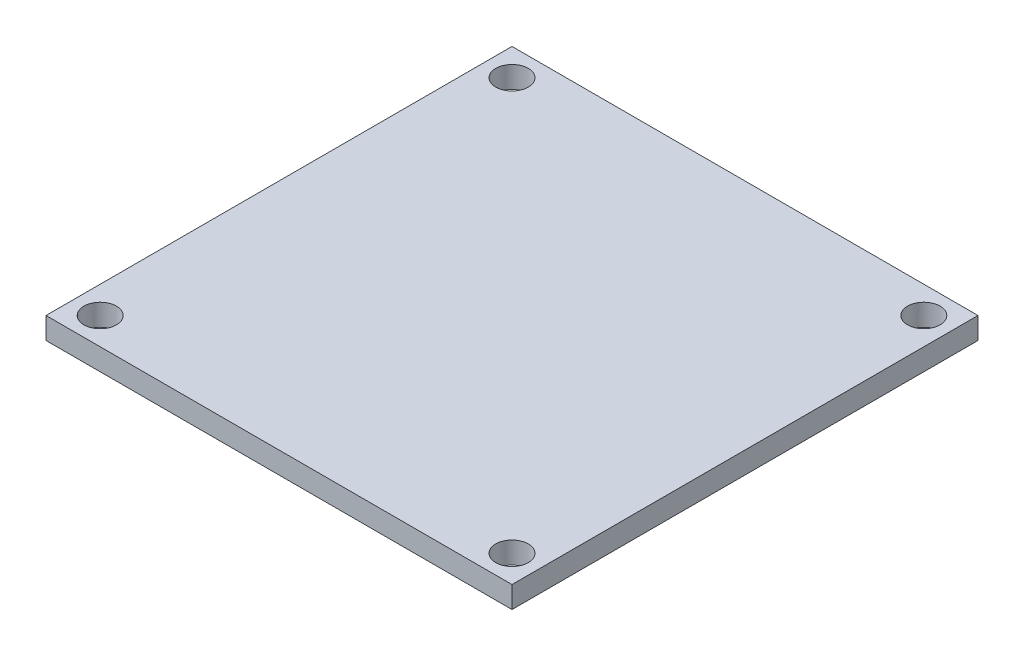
ISO-10303-21;
HEADER;
FILE_DESCRIPTION(('STEP AP214'),'2;1');
FILE_NAME('part.step','',(''),(''),'','','');
FILE_SCHEMA(('AUTOMOTIVE_DESIGN { 1 0 10303 214 1 1 1 1 }'));
ENDSEC;
DATA;
#1=APPLICATION_CONTEXT('core data for automotive mechanical design processes');
#2=APPLICATION_PROTOCOL_DEFINITION('international standard','automotive_design',2000,#1);
#3=PRODUCT_CONTEXT('',#1,'mechanical');
#4=PRODUCT('Part','Part','',(#3));
#5=PRODUCT_RELATED_PRODUCT_CATEGORY('part','',(#4));
#6=PRODUCT_DEFINITION_FORMATION('','',#4);
#7=PRODUCT_DEFINITION_CONTEXT('part definition',#1,'design');
#8=PRODUCT_DEFINITION('design','',#6,#7);
#9=PRODUCT_DEFINITION_SHAPE('','',#8);
#10=(LENGTH_UNIT() NAMED_UNIT(*) SI_UNIT(.MILLI.,.METRE.));
#11=(NAMED_UNIT(*) PLANE_ANGLE_UNIT() SI_UNIT($,.RADIAN.));
#12=(NAMED_UNIT(*) SI_UNIT($,.STERADIAN.) SOLID_ANGLE_UNIT());
#13=UNCERTAINTY_MEASURE_WITH_UNIT(LENGTH_MEASURE(1.E-05),#10,'distance_accuracy_value','');
#14=(GEOMETRIC_REPRESENTATION_CONTEXT(3) GLOBAL_UNCERTAINTY_ASSIGNED_CONTEXT((#13)) GLOBAL_UNIT_ASSIGNED_CONTEXT((#10,
#11,#12)) REPRESENTATION_CONTEXT('',''));
#15=CARTESIAN_POINT('',(0.,0.,0.));
#16=DIRECTION('',(0.,0.,1.));
#17=DIRECTION('',(1.,0.,0.));
#18=AXIS2_PLACEMENT_3D('',#15,#16,#17);
#19=CARTESIAN_POINT('',(21.5,2.,21.5));
#20=DIRECTION('',(-1.,0.,0.));
#21=DIRECTION('',(0.,0.,1.));
#22=AXIS2_PLACEMENT_3D('',#19,#20,#21);
#23=PLANE('',#22);
#24=DIRECTION('',(0.,0.,-1.));
#25=VECTOR('',#24,1.);
#26=CARTESIAN_POINT('',(21.5,0.,21.5));
#27=LINE('',#26,#25);
#28=CARTESIAN_POINT('',(21.5,0.,21.5));
#29=VERTEX_POINT('',#28);
#30=CARTESIAN_POINT('',(21.5,0.,-21.5));
#31=VERTEX_POINT('',#30);
#32=EDGE_CURVE('E96',#29,#31,#27,.T.);
#33=ORIENTED_EDGE('',*,*,#32,.T.);
#34=DIRECTION('',(0.,-1.,0.));
#35=VECTOR('',#34,1.);
#36=CARTESIAN_POINT('',(21.5,2.,-21.5));
#37=LINE('',#36,#35);
#38=CARTESIAN_POINT('',(21.5,2.,-21.5));
#39=VERTEX_POINT('',#38);
#40=EDGE_CURVE('E11',#39,#31,#37,.T.);
#41=ORIENTED_EDGE('',*,*,#40,.F.);
#42=DIRECTION('',(0.,0.,-1.));
#43=VECTOR('',#42,1.);
#44=CARTESIAN_POINT('',(21.5,2.,21.5));
#45=LINE('',#44,#43);
#46=CARTESIAN_POINT('',(21.5,2.,21.5));
#47=VERTEX_POINT('',#46);
#48=EDGE_CURVE('E84',#47,#39,#45,.T.);
#49=ORIENTED_EDGE('',*,*,#48,.F.);
#50=DIRECTION('',(0.,-1.,0.));
#51=VECTOR('',#50,1.);
#52=CARTESIAN_POINT('',(21.5,2.,21.5));
#53=LINE('',#52,#51);
#54=EDGE_CURVE('E92',#47,#29,#53,.T.);
#55=ORIENTED_EDGE('',*,*,#54,.T.);
#56=EDGE_LOOP('',(#33,#41,#49,#55));
#57=FACE_BOUND('',#56,.T.);
#58=ADVANCED_FACE('F33',(#57),#23,.F.);
#59=CARTESIAN_POINT('',(-21.5,2.,-21.5));
#60=DIRECTION('',(0.,0.,1.));
#61=DIRECTION('',(1.,0.,0.));
#62=AXIS2_PLACEMENT_3D('',#59,#60,#61);
#63=PLANE('',#62);
#64=DIRECTION('',(-1.,0.,0.));
#65=VECTOR('',#64,1.);
#66=CARTESIAN_POINT('',(-21.5,0.,-21.5));
#67=LINE('',#66,#65);
#68=CARTESIAN_POINT('',(-21.5,0.,-21.5));
#69=VERTEX_POINT('',#68);
#70=EDGE_CURVE('E88',#31,#69,#67,.T.);
#71=ORIENTED_EDGE('',*,*,#70,.T.);
#72=DIRECTION('',(0.,-1.,0.));
#73=VECTOR('',#72,1.);
#74=CARTESIAN_POINT('',(-21.5,2.,-21.5));
#75=LINE('',#74,#73);
#76=CARTESIAN_POINT('',(-21.5,2.,-21.5));
#77=VERTEX_POINT('',#76);
#78=EDGE_CURVE('E41',#77,#69,#75,.T.);
#79=ORIENTED_EDGE('',*,*,#78,.F.);
#80=DIRECTION('',(-1.,0.,0.));
#81=VECTOR('',#80,1.);
#82=CARTESIAN_POINT('',(-21.5,2.,-21.5));
#83=LINE('',#82,#81);
#84=EDGE_CURVE('E79',#39,#77,#83,.T.);
#85=ORIENTED_EDGE('',*,*,#84,.F.);
#86=ORIENTED_EDGE('',*,*,#40,.T.);
#87=EDGE_LOOP('',(#71,#79,#85,#86));
#88=FACE_BOUND('',#87,.T.);
#89=ADVANCED_FACE('F87',(#88),#63,.F.);
#90=CARTESIAN_POINT('',(-21.5,2.,21.5));
#91=DIRECTION('',(1.,0.,0.));
#92=DIRECTION('',(0.,0.,-1.));
#93=AXIS2_PLACEMENT_3D('',#90,#91,#92);
#94=PLANE('',#93);
#95=DIRECTION('',(0.,0.,1.));
#96=VECTOR('',#95,1.);
#97=CARTESIAN_POINT('',(-21.5,0.,21.5));
#98=LINE('',#97,#96);
#99=CARTESIAN_POINT('',(-21.5,0.,21.5));
#100=VERTEX_POINT('',#99);
#101=EDGE_CURVE('E66',#69,#100,#98,.T.);
#102=ORIENTED_EDGE('',*,*,#101,.T.);
#103=DIRECTION('',(0.,-1.,0.));
#104=VECTOR('',#103,1.);
#105=CARTESIAN_POINT('',(-21.5,2.,21.5));
#106=LINE('',#105,#104);
#107=CARTESIAN_POINT('',(-21.5,2.,21.5));
#108=VERTEX_POINT('',#107);
#109=EDGE_CURVE('E89',#108,#100,#106,.T.);
#110=ORIENTED_EDGE('',*,*,#109,.F.);
#111=DIRECTION('',(0.,0.,1.));
#112=VECTOR('',#111,1.);
#113=CARTESIAN_POINT('',(-21.5,2.,21.5));
#114=LINE('',#113,#112);
#115=EDGE_CURVE('E82',#77,#108,#114,.T.);
#116=ORIENTED_EDGE('',*,*,#115,.F.);
#117=ORIENTED_EDGE('',*,*,#78,.T.);
#118=EDGE_LOOP('',(#102,#110,#116,#117));
#119=FACE_BOUND('',#118,.T.);
#120=ADVANCED_FACE('F90',(#119),#94,.F.);
#121=CARTESIAN_POINT('',(-21.5,2.,21.5));
#122=DIRECTION('',(0.,0.,-1.));
#123=DIRECTION('',(-1.,0.,0.));
#124=AXIS2_PLACEMENT_3D('',#121,#122,#123);
#125=PLANE('',#124);
#126=DIRECTION('',(1.,0.,0.));
#127=VECTOR('',#126,1.);
#128=CARTESIAN_POINT('',(-21.5,0.,21.5));
#129=LINE('',#128,#127);
#130=EDGE_CURVE('E72',#100,#29,#129,.T.);
#131=ORIENTED_EDGE('',*,*,#130,.T.);
#132=ORIENTED_EDGE('',*,*,#54,.F.);
#133=DIRECTION('',(1.,0.,0.));
#134=VECTOR('',#133,1.);
#135=CARTESIAN_POINT('',(-21.5,2.,21.5));
#136=LINE('',#135,#134);
#137=EDGE_CURVE('E49',#108,#47,#136,.T.);
#138=ORIENTED_EDGE('',*,*,#137,.F.);
#139=ORIENTED_EDGE('',*,*,#109,.T.);
#140=EDGE_LOOP('',(#131,#132,#138,#139));
#141=FACE_BOUND('',#140,.T.);
#142=ADVANCED_FACE('F104',(#141),#125,.F.);
#143=CARTESIAN_POINT('',(0.,2.,0.));
#144=DIRECTION('',(0.,-1.,0.));
#145=DIRECTION('',(0.,0.,-1.));
#146=AXIS2_PLACEMENT_3D('',#143,#144,#145);
#147=PLANE('',#146);
#148=CARTESIAN_POINT('',(19.,2.,-19.));
#149=DIRECTION('',(0.,1.,0.));
#150=DIRECTION('',(0.,0.,1.));
#151=AXIS2_PLACEMENT_3D('',#148,#149,#150);
#152=CIRCLE('',#151,1.5);
#153=CARTESIAN_POINT('',(19.,2.,-17.5));
#154=VERTEX_POINT('',#153);
#155=EDGE_CURVE('E123',#154,#154,#152,.T.);
#156=ORIENTED_EDGE('',*,*,#155,.F.);
#157=EDGE_LOOP('',(#156));
#158=FACE_BOUND('',#157,.T.);
#159=CARTESIAN_POINT('',(-19.,2.,19.));
#160=DIRECTION('',(0.,1.,0.));
#161=DIRECTION('',(0.,0.,1.));
#162=AXIS2_PLACEMENT_3D('',#159,#160,#161);
#163=CIRCLE('',#162,1.5);
#164=CARTESIAN_POINT('',(-19.,2.,20.5));
#165=VERTEX_POINT('',#164);
#166=EDGE_CURVE('E116',#165,#165,#163,.T.);
#167=ORIENTED_EDGE('',*,*,#166,.F.);
#168=EDGE_LOOP('',(#167));
#169=FACE_BOUND('',#168,.T.);
#170=CARTESIAN_POINT('',(19.,2.,19.));
#171=DIRECTION('',(0.,1.,0.));
#172=DIRECTION('',(0.,0.,1.));
#173=AXIS2_PLACEMENT_3D('',#170,#171,#172);
#174=CIRCLE('',#173,1.5);
#175=CARTESIAN_POINT('',(19.,2.,20.5));
#176=VERTEX_POINT('',#175);
#177=EDGE_CURVE('E128',#176,#176,#174,.T.);
#178=ORIENTED_EDGE('',*,*,#177,.F.);
#179=EDGE_LOOP('',(#178));
#180=FACE_BOUND('',#179,.T.);
#181=CARTESIAN_POINT('',(-19.,2.,-19.));
#182=DIRECTION('',(0.,1.,0.));
#183=DIRECTION('',(0.,0.,1.));
#184=AXIS2_PLACEMENT_3D('',#181,#182,#183);
#185=CIRCLE('',#184,1.5);
#186=CARTESIAN_POINT('',(-19.,2.,-17.5));
#187=VERTEX_POINT('',#186);
#188=EDGE_CURVE('E110',#187,#187,#185,.T.);
#189=ORIENTED_EDGE('',*,*,#188,.F.);
#190=EDGE_LOOP('',(#189));
#191=FACE_BOUND('',#190,.T.);
#192=ORIENTED_EDGE('',*,*,#48,.T.);
#193=ORIENTED_EDGE('',*,*,#84,.T.);
#194=ORIENTED_EDGE('',*,*,#115,.T.);
#195=ORIENTED_EDGE('',*,*,#137,.T.);
#196=EDGE_LOOP('',(#192,#193,#194,#195));
#197=FACE_BOUND('',#196,.T.);
#198=ADVANCED_FACE('F80',(#158,#169,#180,#191,#197),#147,.F.);
#199=CARTESIAN_POINT('',(0.,0.,0.));
#200=DIRECTION('',(0.,-1.,0.));
#201=DIRECTION('',(0.,0.,-1.));
#202=AXIS2_PLACEMENT_3D('',#199,#200,#201);
#203=PLANE('',#202);
#204=CARTESIAN_POINT('',(19.,0.,-19.));
#205=DIRECTION('',(0.,1.,0.));
#206=DIRECTION('',(0.,0.,1.));
#207=AXIS2_PLACEMENT_3D('',#204,#205,#206);
#208=CIRCLE('',#207,1.5);
#209=CARTESIAN_POINT('',(19.,0.,-17.5));
#210=VERTEX_POINT('',#209);
#211=EDGE_CURVE('E113',#210,#210,#208,.T.);
#212=ORIENTED_EDGE('',*,*,#211,.T.);
#213=EDGE_LOOP('',(#212));
#214=FACE_BOUND('',#213,.T.);
#215=CARTESIAN_POINT('',(-19.,0.,19.));
#216=DIRECTION('',(0.,1.,0.));
#217=DIRECTION('',(0.,0.,1.));
#218=AXIS2_PLACEMENT_3D('',#215,#216,#217);
#219=CIRCLE('',#218,1.5);
#220=CARTESIAN_POINT('',(-19.,0.,20.5));
#221=VERTEX_POINT('',#220);
#222=EDGE_CURVE('E119',#221,#221,#219,.T.);
#223=ORIENTED_EDGE('',*,*,#222,.T.);
#224=EDGE_LOOP('',(#223));
#225=FACE_BOUND('',#224,.T.);
#226=CARTESIAN_POINT('',(19.,0.,19.));
#227=DIRECTION('',(0.,1.,0.));
#228=DIRECTION('',(0.,0.,1.));
#229=AXIS2_PLACEMENT_3D('',#226,#227,#228);
#230=CIRCLE('',#229,1.5);
#231=CARTESIAN_POINT('',(19.,0.,20.5));
#232=VERTEX_POINT('',#231);
#233=EDGE_CURVE('E120',#232,#232,#230,.T.);
#234=ORIENTED_EDGE('',*,*,#233,.T.);
#235=EDGE_LOOP('',(#234));
#236=FACE_BOUND('',#235,.T.);
#237=CARTESIAN_POINT('',(-19.,0.,-19.));
#238=DIRECTION('',(0.,1.,0.));
#239=DIRECTION('',(0.,0.,1.));
#240=AXIS2_PLACEMENT_3D('',#237,#238,#239);
#241=CIRCLE('',#240,1.5);
#242=CARTESIAN_POINT('',(-19.,0.,-17.5));
#243=VERTEX_POINT('',#242);
#244=EDGE_CURVE('E99',#243,#243,#241,.T.);
#245=ORIENTED_EDGE('',*,*,#244,.T.);
#246=EDGE_LOOP('',(#245));
#247=FACE_BOUND('',#246,.T.);
#248=ORIENTED_EDGE('',*,*,#32,.F.);
#249=ORIENTED_EDGE('',*,*,#130,.F.);
#250=ORIENTED_EDGE('',*,*,#101,.F.);
#251=ORIENTED_EDGE('',*,*,#70,.F.);
#252=EDGE_LOOP('',(#248,#249,#250,#251));
#253=FACE_BOUND('',#252,.T.);
#254=ADVANCED_FACE('F107',(#214,#225,#236,#247,#253),#203,.T.);
#255=CARTESIAN_POINT('',(-19.,0.,-19.));
#256=DIRECTION('',(0.,1.,0.));
#257=DIRECTION('',(0.,0.,1.));
#258=AXIS2_PLACEMENT_3D('',#255,#256,#257);
#259=CYLINDRICAL_SURFACE('',#258,1.5);
#260=ORIENTED_EDGE('',*,*,#244,.F.);
#261=EDGE_LOOP('',(#260));
#262=FACE_BOUND('',#261,.T.);
#263=ORIENTED_EDGE('',*,*,#188,.T.);
#264=EDGE_LOOP('',(#263));
#265=FACE_BOUND('',#264,.T.);
#266=ADVANCED_FACE('F140',(#262,#265),#259,.F.);
#267=CARTESIAN_POINT('',(19.,0.,19.));
#268=DIRECTION('',(0.,1.,0.));
#269=DIRECTION('',(0.,0.,1.));
#270=AXIS2_PLACEMENT_3D('',#267,#268,#269);
#271=CYLINDRICAL_SURFACE('',#270,1.5);
#272=ORIENTED_EDGE('',*,*,#233,.F.);
#273=EDGE_LOOP('',(#272));
#274=FACE_BOUND('',#273,.T.);
#275=ORIENTED_EDGE('',*,*,#177,.T.);
#276=EDGE_LOOP('',(#275));
#277=FACE_BOUND('',#276,.T.);
#278=ADVANCED_FACE('F136',(#274,#277),#271,.F.);
#279=CARTESIAN_POINT('',(-19.,0.,19.));
#280=DIRECTION('',(0.,1.,0.));
#281=DIRECTION('',(0.,0.,1.));
#282=AXIS2_PLACEMENT_3D('',#279,#280,#281);
#283=CYLINDRICAL_SURFACE('',#282,1.5);
#284=ORIENTED_EDGE('',*,*,#222,.F.);
#285=EDGE_LOOP('',(#284));
#286=FACE_BOUND('',#285,.T.);
#287=ORIENTED_EDGE('',*,*,#166,.T.);
#288=EDGE_LOOP('',(#287));
#289=FACE_BOUND('',#288,.T.);
#290=ADVANCED_FACE('F139',(#286,#289),#283,.F.);
#291=CARTESIAN_POINT('',(19.,0.,-19.));
#292=DIRECTION('',(0.,1.,0.));
#293=DIRECTION('',(0.,0.,1.));
#294=AXIS2_PLACEMENT_3D('',#291,#292,#293);
#295=CYLINDRICAL_SURFACE('',#294,1.5);
#296=ORIENTED_EDGE('',*,*,#211,.F.);
#297=EDGE_LOOP('',(#296));
#298=FACE_BOUND('',#297,.T.);
#299=ORIENTED_EDGE('',*,*,#155,.T.);
#300=EDGE_LOOP('',(#299));
#301=FACE_BOUND('',#300,.T.);
#302=ADVANCED_FACE('F201',(#298,#301),#295,.F.);
#303=CLOSED_SHELL('',(#58,#89,#120,#142,#198,#254,#266,#278,#290,#302));
#304=MANIFOLD_SOLID_BREP('B2',#303);
#305=ADVANCED_BREP_SHAPE_REPRESENTATION('',(#18,#304),#14);
#306=SHAPE_DEFINITION_REPRESENTATION(#9,#305);
ENDSEC;
END-ISO-10303-21;
